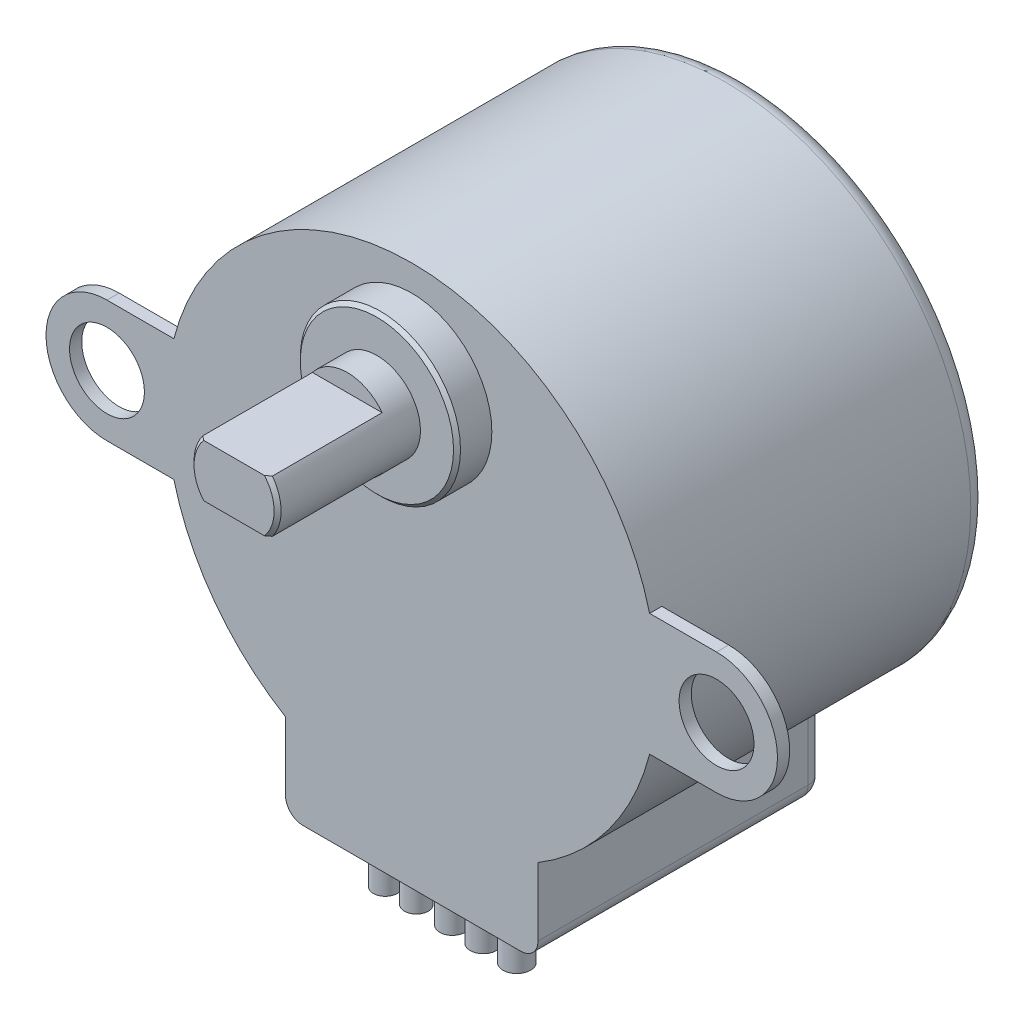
from build123d import *

# Parameters (mm, degrees)
SKETCH_1_R          = 14.1
EXTRUDE_1_DEPTH     = 19
SKETCH_2_R          = 2.15
EXTRUDE_2_DEPTH     = 0.7
FILLET_1_R          = 1
SKETCH_3_R          = 4.6
EXTRUDE_3_DEPTH     = 2
SKETCH_4_R          = 2.5
EXTRUDE_4_DEPTH     = 8.2
CUT_EXTRUDE_START   = -6.5
CUT_EXTRUDE_1_DEPTH = 6.5
CHAMFER_1_SIZE      = 0.2
EXTRUDE_START       = -16.5
EXTRUDE_5_DEPTH     = 16.5
FILLET_2_R          = 1
SKETCH_7_R          = 0.693296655
SKETCH_7_R_2        = 0.683224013
SKETCH_7_R_3        = 0.721072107
SKETCH_7_R_4        = 0.752437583
SKETCH_7_R_5        = 0.788430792
EXTRUDE_6_DEPTH     = 3


with BuildPart() as part:
    # Sketch 1 → Extrude 1 (new body)
    with BuildSketch(Plane.XY):
        Circle(SKETCH_1_R)
    extrude(amount=EXTRUDE_1_DEPTH)

    # Sketch 2 → Extrude 2 (add)
    with BuildSketch(Plane.XY.offset(19)):
        with BuildLine():
            Line((-17.5, 3.5), (17.5, 3.5))
            ThreePointArc((17.5, 3.5), (21, 0), (17.5, -3.5))
            Line((17.5, -3.5), (-17.5, -3.5))
            ThreePointArc((-17.5, -3.5), (-21, 0), (-17.5, 3.5))
        make_face()
        with Locations((-17.5, 0)):
            Circle(SKETCH_2_R, mode=Mode.SUBTRACT)
        with Locations(Location((17.5, 0, 0), (0, 0, 180))):
            Circle(SKETCH_2_R, mode=Mode.SUBTRACT)
    extrude(amount=-EXTRUDE_2_DEPTH)

    # Fillet 1
    fillet_1_edges = [part.edges().sort_by_distance(p)[0] for p in [
        (-14.1, 0, 0),
    ]]
    fillet(fillet_1_edges, radius=FILLET_1_R)

    # Sketch 3 → Extrude 3 (add)
    with BuildSketch(Plane.XY.offset(19)):
        with Locations((0, 8)):
            Circle(SKETCH_3_R)
    extrude(amount=EXTRUDE_3_DEPTH)

    # Sketch 4 → Extrude 4 (add)
    with BuildSketch(Plane.XY.offset(21)):
        with Locations((0, 8)):
            Circle(SKETCH_4_R)
    extrude(amount=EXTRUDE_4_DEPTH)

    # Sketch 5 → Cut-Extrude 1 (cut)
    with BuildSketch(Plane.XY.offset(29.2).offset(CUT_EXTRUDE_START)):
        with BuildLine():
            Line((-2, 9.5), (2, 9.5))
            ThreePointArc((2, 9.5), (0, 10.5), (-2, 9.5))
        make_face()
        with BuildLine():
            Line((-2, 6.5), (2, 6.5))
            ThreePointArc((2, 6.5), (0, 5.5), (-2, 6.5))
        make_face()
    extrude(amount=CUT_EXTRUDE_1_DEPTH, mode=Mode.SUBTRACT)

    # Chamfer 1
    chamfer_1_edges = [part.edges().sort_by_distance(p)[0] for p in [
        (-4.6, 8, 21),
        (-2.5, 8, 29.2),
        (2.371708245, 8.790569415, 29.2),
    ]]
    chamfer(chamfer_1_edges, length=CHAMFER_1_SIZE)

    # Sketch 6 → Extrude 5 (add)
    with BuildSketch(Plane.XY.offset(19).offset(EXTRUDE_START)):
        with BuildLine():
            Line((-7.25, -12.09328326), (-7.25, -17))
            Line((-7.25, -17), (7.25, -17))
            Line((7.25, -17), (7.25, -12.09328326))
            ThreePointArc((7.25, -12.09328326), (0, -14.1), (-7.25, -12.09328326))
        make_face()
    extrude(amount=EXTRUDE_5_DEPTH)

    # Fillet 2
    fillet_2_edges = [part.edges().sort_by_distance(p)[0] for p in [
        (7.25, -14.54664163, 2.5),
        (0, -17, 2.5),
        (7.25, -17, 10.75),
        (-7.25, -14.54664163, 2.5),
        (-7.25, -17, 10.75),
    ]]
    fillet(fillet_2_edges, radius=FILLET_2_R)

    # Sketch 7 → Extrude 6 (add)
    with BuildSketch(Plane.XZ.offset(17)):
        with Locations((-3.845717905, 16.667073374)):
            Circle(SKETCH_7_R)
        with Locations((-2.067073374, 16.667073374)):
            Circle(SKETCH_7_R_2)
        with Locations((0, 16.667073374)):
            Circle(SKETCH_7_R_3)
        with Locations((1.778644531, 16.667073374)):
            Circle(SKETCH_7_R_4)
        with Locations((3.701503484, 16.667073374)):
            Circle(SKETCH_7_R_5)
    extrude(amount=EXTRUDE_6_DEPTH)


solid = part.part
